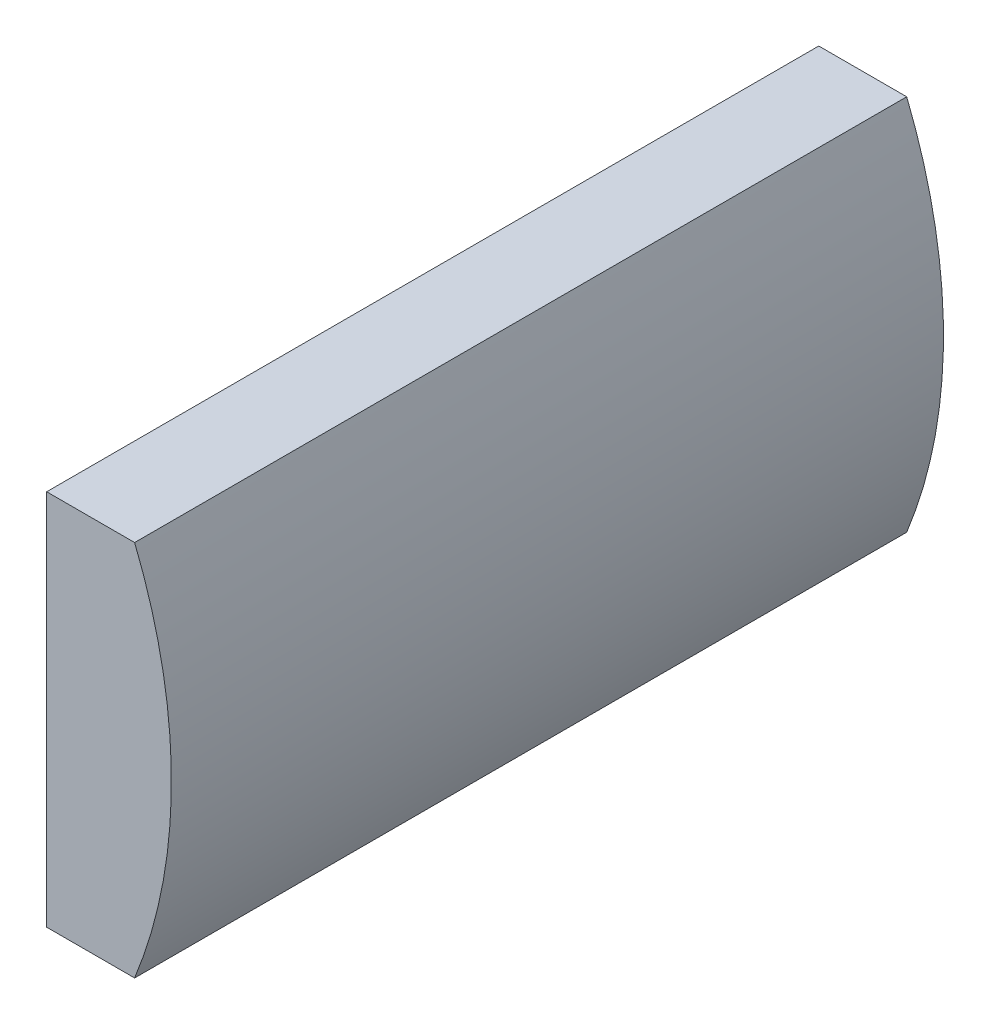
ISO-10303-21;
HEADER;
FILE_DESCRIPTION(('STEP AP214'),'2;1');
FILE_NAME('part.step','',(''),(''),'','','');
FILE_SCHEMA(('AUTOMOTIVE_DESIGN { 1 0 10303 214 1 1 1 1 }'));
ENDSEC;
DATA;
#1=APPLICATION_CONTEXT('core data for automotive mechanical design processes');
#2=APPLICATION_PROTOCOL_DEFINITION('international standard','automotive_design',2000,#1);
#3=PRODUCT_CONTEXT('',#1,'mechanical');
#4=PRODUCT('Part','Part','',(#3));
#5=PRODUCT_RELATED_PRODUCT_CATEGORY('part','',(#4));
#6=PRODUCT_DEFINITION_FORMATION('','',#4);
#7=PRODUCT_DEFINITION_CONTEXT('part definition',#1,'design');
#8=PRODUCT_DEFINITION('design','',#6,#7);
#9=PRODUCT_DEFINITION_SHAPE('','',#8);
#10=(LENGTH_UNIT() NAMED_UNIT(*) SI_UNIT(.MILLI.,.METRE.));
#11=(NAMED_UNIT(*) PLANE_ANGLE_UNIT() SI_UNIT($,.RADIAN.));
#12=(NAMED_UNIT(*) SI_UNIT($,.STERADIAN.) SOLID_ANGLE_UNIT());
#13=UNCERTAINTY_MEASURE_WITH_UNIT(LENGTH_MEASURE(1.E-05),#10,'distance_accuracy_value','');
#14=(GEOMETRIC_REPRESENTATION_CONTEXT(3) GLOBAL_UNCERTAINTY_ASSIGNED_CONTEXT((#13)) GLOBAL_UNIT_ASSIGNED_CONTEXT((#10,
#11,#12)) REPRESENTATION_CONTEXT('',''));
#15=CARTESIAN_POINT('',(0.,0.,0.));
#16=DIRECTION('',(0.,0.,1.));
#17=DIRECTION('',(1.,0.,0.));
#18=AXIS2_PLACEMENT_3D('',#15,#16,#17);
#19=CARTESIAN_POINT('',(6.35,-3.175,13.));
#20=DIRECTION('',(-1.,0.,0.));
#21=DIRECTION('',(0.,0.,1.));
#22=AXIS2_PLACEMENT_3D('',#19,#20,#21);
#23=PLANE('',#22);
#24=DIRECTION('',(0.,1.,0.));
#25=VECTOR('',#24,1.);
#26=CARTESIAN_POINT('',(6.35,0.,13.));
#27=LINE('',#26,#25);
#28=CARTESIAN_POINT('',(6.35,3.175,13.));
#29=VERTEX_POINT('',#28);
#30=CARTESIAN_POINT('',(6.35,-3.175,13.));
#31=VERTEX_POINT('',#30);
#32=EDGE_CURVE('E77',#29,#31,#27,.F.);
#33=ORIENTED_EDGE('',*,*,#32,.F.);
#34=DIRECTION('',(0.,0.,1.));
#35=VECTOR('',#34,1.);
#36=CARTESIAN_POINT('',(6.35,3.175,13.));
#37=LINE('',#36,#35);
#38=CARTESIAN_POINT('',(6.35,3.175,0.));
#39=VERTEX_POINT('',#38);
#40=EDGE_CURVE('E76',#39,#29,#37,.T.);
#41=ORIENTED_EDGE('',*,*,#40,.F.);
#42=DIRECTION('',(0.,1.,0.));
#43=VECTOR('',#42,1.);
#44=CARTESIAN_POINT('',(6.35,0.,0.));
#45=LINE('',#44,#43);
#46=CARTESIAN_POINT('',(6.35,-3.175,0.));
#47=VERTEX_POINT('',#46);
#48=EDGE_CURVE('E66',#39,#47,#45,.F.);
#49=ORIENTED_EDGE('',*,*,#48,.T.);
#50=DIRECTION('',(0.,0.,1.));
#51=VECTOR('',#50,1.);
#52=CARTESIAN_POINT('',(6.35,-3.175,13.));
#53=LINE('',#52,#51);
#54=EDGE_CURVE('E59',#47,#31,#53,.T.);
#55=ORIENTED_EDGE('',*,*,#54,.T.);
#56=EDGE_LOOP('',(#33,#41,#49,#55));
#57=FACE_BOUND('',#56,.T.);
#58=ADVANCED_FACE('F16',(#57),#23,.T.);
#59=CARTESIAN_POINT('',(0.,0.,0.));
#60=DIRECTION('',(0.,0.,1.));
#61=DIRECTION('',(1.,0.,0.));
#62=AXIS2_PLACEMENT_3D('',#59,#60,#61);
#63=PLANE('',#62);
#64=DIRECTION('',(1.,0.,0.));
#65=VECTOR('',#64,1.);
#66=CARTESIAN_POINT('',(6.35,3.175,0.));
#67=LINE('',#66,#65);
#68=CARTESIAN_POINT('',(7.83082850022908,3.175,0.));
#69=VERTEX_POINT('',#68);
#70=EDGE_CURVE('E70',#69,#39,#67,.F.);
#71=ORIENTED_EDGE('',*,*,#70,.F.);
#72=CARTESIAN_POINT('',(0.,0.,0.));
#73=DIRECTION('',(0.,0.,-1.));
#74=DIRECTION('',(-1.,0.,0.));
#75=AXIS2_PLACEMENT_3D('',#72,#73,#74);
#76=CIRCLE('',#75,8.45);
#77=CARTESIAN_POINT('',(7.83082850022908,-3.175,0.));
#78=VERTEX_POINT('',#77);
#79=EDGE_CURVE('E19',#78,#69,#76,.F.);
#80=ORIENTED_EDGE('',*,*,#79,.F.);
#81=DIRECTION('',(1.,0.,0.));
#82=VECTOR('',#81,1.);
#83=CARTESIAN_POINT('',(6.35,-3.175,0.));
#84=LINE('',#83,#82);
#85=EDGE_CURVE('E72',#78,#47,#84,.F.);
#86=ORIENTED_EDGE('',*,*,#85,.T.);
#87=ORIENTED_EDGE('',*,*,#48,.F.);
#88=EDGE_LOOP('',(#71,#80,#86,#87));
#89=FACE_BOUND('',#88,.T.);
#90=ADVANCED_FACE('F68',(#89),#63,.F.);
#91=CARTESIAN_POINT('',(6.35,3.175,13.));
#92=DIRECTION('',(0.,1.,0.));
#93=DIRECTION('',(0.,0.,1.));
#94=AXIS2_PLACEMENT_3D('',#91,#92,#93);
#95=PLANE('',#94);
#96=DIRECTION('',(1.,0.,0.));
#97=VECTOR('',#96,1.);
#98=CARTESIAN_POINT('',(0.,3.175,13.));
#99=LINE('',#98,#97);
#100=CARTESIAN_POINT('',(7.83082850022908,3.175,13.));
#101=VERTEX_POINT('',#100);
#102=EDGE_CURVE('E103',#101,#29,#99,.F.);
#103=ORIENTED_EDGE('',*,*,#102,.F.);
#104=DIRECTION('',(0.,0.,-1.));
#105=VECTOR('',#104,1.);
#106=CARTESIAN_POINT('',(7.83082850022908,3.175,13.));
#107=LINE('',#106,#105);
#108=EDGE_CURVE('E84',#69,#101,#107,.F.);
#109=ORIENTED_EDGE('',*,*,#108,.F.);
#110=ORIENTED_EDGE('',*,*,#70,.T.);
#111=ORIENTED_EDGE('',*,*,#40,.T.);
#112=EDGE_LOOP('',(#103,#109,#110,#111));
#113=FACE_BOUND('',#112,.T.);
#114=ADVANCED_FACE('F82',(#113),#95,.T.);
#115=CARTESIAN_POINT('',(0.,0.,13.));
#116=DIRECTION('',(0.,0.,1.));
#117=DIRECTION('',(1.,0.,0.));
#118=AXIS2_PLACEMENT_3D('',#115,#116,#117);
#119=PLANE('',#118);
#120=CARTESIAN_POINT('',(0.,0.,13.));
#121=DIRECTION('',(0.,0.,-1.));
#122=DIRECTION('',(-1.,0.,0.));
#123=AXIS2_PLACEMENT_3D('',#120,#121,#122);
#124=CIRCLE('',#123,8.45);
#125=CARTESIAN_POINT('',(7.83082850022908,-3.175,13.));
#126=VERTEX_POINT('',#125);
#127=EDGE_CURVE('E26',#101,#126,#124,.T.);
#128=ORIENTED_EDGE('',*,*,#127,.F.);
#129=ORIENTED_EDGE('',*,*,#102,.T.);
#130=ORIENTED_EDGE('',*,*,#32,.T.);
#131=DIRECTION('',(1.,0.,0.));
#132=VECTOR('',#131,1.);
#133=CARTESIAN_POINT('',(6.35,-3.175,13.));
#134=LINE('',#133,#132);
#135=EDGE_CURVE('E35',#31,#126,#134,.T.);
#136=ORIENTED_EDGE('',*,*,#135,.T.);
#137=EDGE_LOOP('',(#128,#129,#130,#136));
#138=FACE_BOUND('',#137,.T.);
#139=ADVANCED_FACE('F117',(#138),#119,.T.);
#140=CARTESIAN_POINT('',(6.35,-3.175,13.));
#141=DIRECTION('',(0.,1.,0.));
#142=DIRECTION('',(0.,0.,1.));
#143=AXIS2_PLACEMENT_3D('',#140,#141,#142);
#144=PLANE('',#143);
#145=DIRECTION('',(0.,0.,-1.));
#146=VECTOR('',#145,1.);
#147=CARTESIAN_POINT('',(7.83082850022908,-3.175,13.));
#148=LINE('',#147,#146);
#149=EDGE_CURVE('E11',#126,#78,#148,.T.);
#150=ORIENTED_EDGE('',*,*,#149,.F.);
#151=ORIENTED_EDGE('',*,*,#135,.F.);
#152=ORIENTED_EDGE('',*,*,#54,.F.);
#153=ORIENTED_EDGE('',*,*,#85,.F.);
#154=EDGE_LOOP('',(#150,#151,#152,#153));
#155=FACE_BOUND('',#154,.T.);
#156=ADVANCED_FACE('F119',(#155),#144,.F.);
#157=CARTESIAN_POINT('',(0.,0.,13.));
#158=DIRECTION('',(0.,0.,-1.));
#159=DIRECTION('',(-1.,0.,0.));
#160=AXIS2_PLACEMENT_3D('',#157,#158,#159);
#161=CYLINDRICAL_SURFACE('',#160,8.45);
#162=ORIENTED_EDGE('',*,*,#127,.T.);
#163=ORIENTED_EDGE('',*,*,#149,.T.);
#164=ORIENTED_EDGE('',*,*,#79,.T.);
#165=ORIENTED_EDGE('',*,*,#108,.T.);
#166=EDGE_LOOP('',(#162,#163,#164,#165));
#167=FACE_BOUND('',#166,.T.);
#168=ADVANCED_FACE('F120',(#167),#161,.T.);
#169=CLOSED_SHELL('',(#58,#90,#114,#139,#156,#168));
#170=MANIFOLD_SOLID_BREP('B1',#169);
#171=ADVANCED_BREP_SHAPE_REPRESENTATION('',(#18,#170),#14);
#172=SHAPE_DEFINITION_REPRESENTATION(#9,#171);
ENDSEC;
END-ISO-10303-21;
